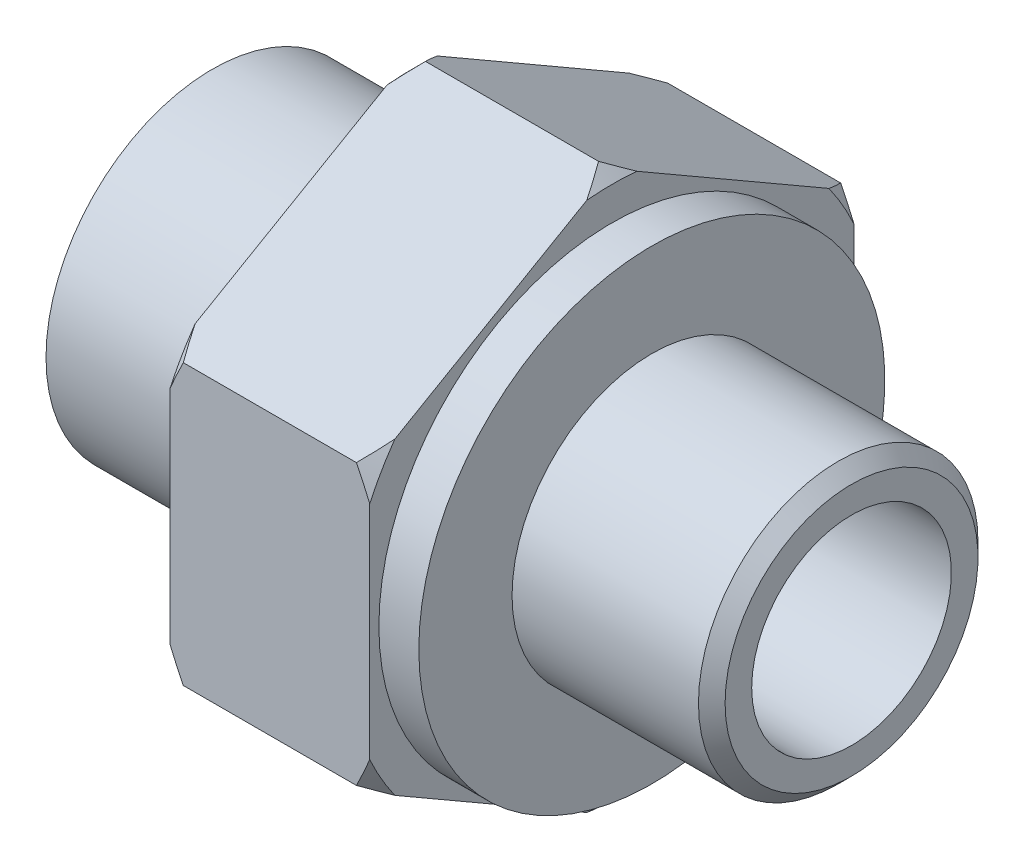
from build123d import *

# Parameters (mm, degrees)
CHANFREIN1_SIZE         = 1
ESQUISSE2_OUTSIDE_W     = 59.274
ESQUISSE2_OUTSIDE_H     = 59.274
ENL_V_MAT_EXTRU_1_DEPTH = 45.395945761


with BuildPart() as part:
    # Esquisse1 → R_volution1 (revolve)
    with BuildSketch(Plane.XY, mode=Mode.PRIVATE) as r_volution1_sk:
        Polygon((43.573556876, 7.5), (43.573556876, 10.4975), (28.573556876, 10.4975), (28.573556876, 17.5), (25.573556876, 17.5), (25.573556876, 21), (10.573556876, 21), (10.573556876, 12.5), (-4.426443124, 12.5), (-4.426443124, 9), (23.298380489, 9), (23.298380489, 7.5), align=None)
    revolve(r_volution1_sk.sketch.rotate(Axis((-49.434162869, 0, 0), (1, 0, 0)), 90), axis=Axis((-49.434162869, 0, 0), (1, 0, 0)))

    # Chanfrein1
    chanfrein1_edges = [part.edges().sort_by_distance(p)[0] for p in [
        (10.573556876, 0, -21),
        (25.573556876, 0, -21),
        (43.573556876, 0, -10.4975),
    ]]
    chamfer(chanfrein1_edges, length=CHANFREIN1_SIZE)

    # Esquisse2 outside → Enl_v. mat.-Extru.1 (cut, through all)
    with BuildSketch(Plane.ZY.offset(-10.573556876)):
        Rectangle(ESQUISSE2_OUTSIDE_W, ESQUISSE2_OUTSIDE_H)
        Polygon((0, 21), (-18.186533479, 10.5), (-18.186533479, -10.5), (0, -21), (18.186533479, -10.5), (18.186533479, 10.5), align=None, mode=Mode.SUBTRACT)
    extrude(amount=-ENL_V_MAT_EXTRU_1_DEPTH, mode=Mode.SUBTRACT)


solid = part.part
